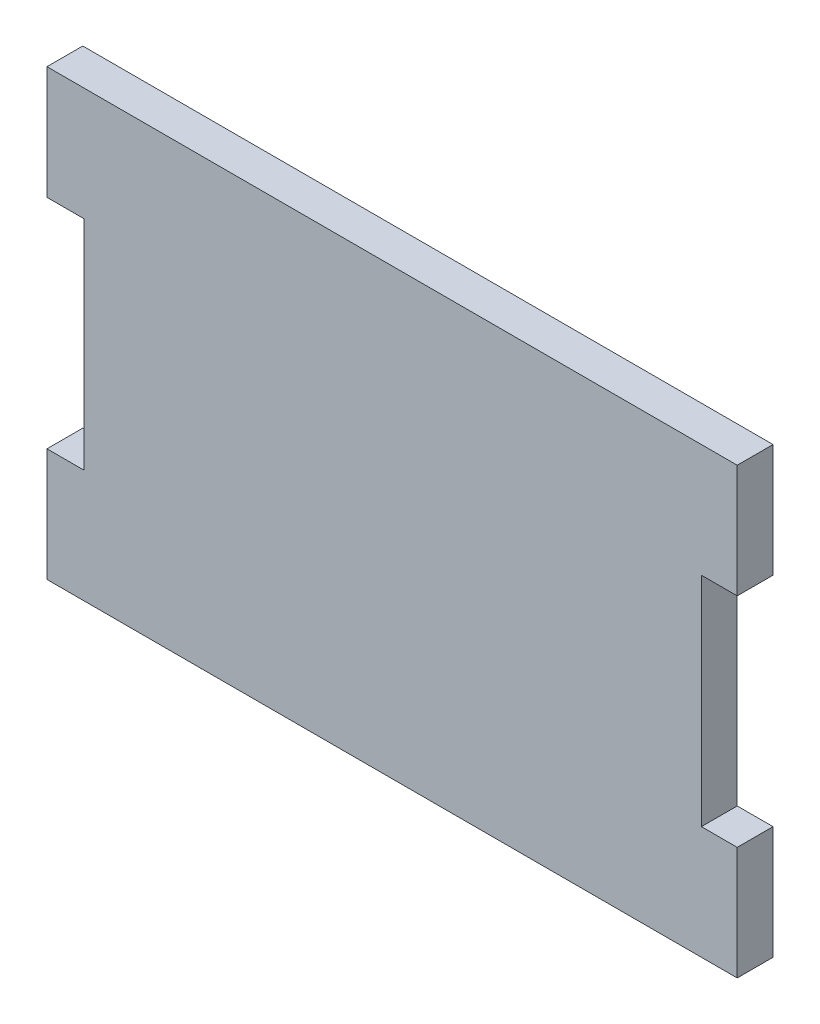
from build123d import *

# Parameters (mm, degrees)
BOSS_EXTRUDE1_DEPTH = 2.5


with BuildPart() as part:
    # Sketch1 → Boss-Extrude1 (new body)
    with BuildSketch(Plane.XY):
        Polygon((48.18325996, 7.6), (48.18325996, 15.5), (0, 15.5), (0, 7.6), (2.6, 7.6), (2.6, -7.6), (0, -7.6), (0, -15.5), (48.18325996, -15.5), (48.18325996, -7.6), (45.68325996, -7.6), (45.68325996, 7.6), align=None)
    extrude(amount=BOSS_EXTRUDE1_DEPTH)


solid = part.part
